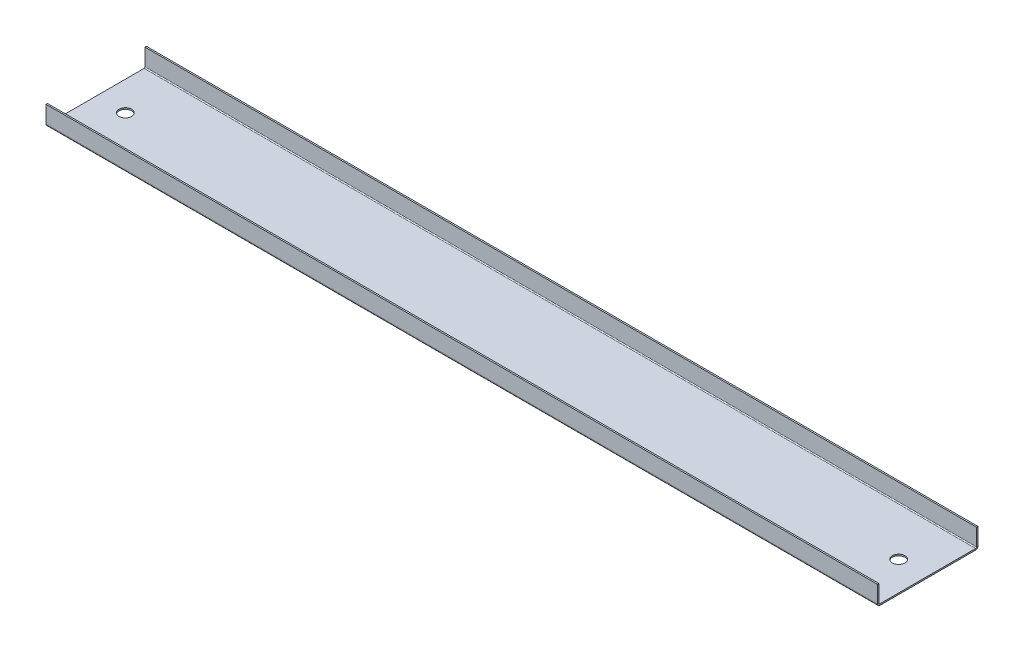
ISO-10303-21;
HEADER;
FILE_DESCRIPTION(('STEP AP214'),'2;1');
FILE_NAME('part.step','',(''),(''),'','','');
FILE_SCHEMA(('AUTOMOTIVE_DESIGN { 1 0 10303 214 1 1 1 1 }'));
ENDSEC;
DATA;
#1=APPLICATION_CONTEXT('core data for automotive mechanical design processes');
#2=APPLICATION_PROTOCOL_DEFINITION('international standard','automotive_design',2000,#1);
#3=PRODUCT_CONTEXT('',#1,'mechanical');
#4=PRODUCT('Part','Part','',(#3));
#5=PRODUCT_RELATED_PRODUCT_CATEGORY('part','',(#4));
#6=PRODUCT_DEFINITION_FORMATION('','',#4);
#7=PRODUCT_DEFINITION_CONTEXT('part definition',#1,'design');
#8=PRODUCT_DEFINITION('design','',#6,#7);
#9=PRODUCT_DEFINITION_SHAPE('','',#8);
#10=(LENGTH_UNIT() NAMED_UNIT(*) SI_UNIT(.MILLI.,.METRE.));
#11=(NAMED_UNIT(*) PLANE_ANGLE_UNIT() SI_UNIT($,.RADIAN.));
#12=(NAMED_UNIT(*) SI_UNIT($,.STERADIAN.) SOLID_ANGLE_UNIT());
#13=UNCERTAINTY_MEASURE_WITH_UNIT(LENGTH_MEASURE(1.E-05),#10,'distance_accuracy_value','');
#14=(GEOMETRIC_REPRESENTATION_CONTEXT(3) GLOBAL_UNCERTAINTY_ASSIGNED_CONTEXT((#13)) GLOBAL_UNIT_ASSIGNED_CONTEXT((#10,
#11,#12)) REPRESENTATION_CONTEXT('',''));
#15=CARTESIAN_POINT('',(0.,0.,0.));
#16=DIRECTION('',(0.,0.,1.));
#17=DIRECTION('',(1.,0.,0.));
#18=AXIS2_PLACEMENT_3D('',#15,#16,#17);
#19=CARTESIAN_POINT('',(-428.4,-334.3,1.49999999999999));
#20=DIRECTION('',(1.,0.,0.));
#21=DIRECTION('',(0.,0.,-1.));
#22=AXIS2_PLACEMENT_3D('',#19,#20,#21);
#23=PLANE('',#22);
#24=DIRECTION('',(0.,-1.,0.));
#25=VECTOR('',#24,1.);
#26=CARTESIAN_POINT('',(-428.4,-332.8,101.));
#27=LINE('',#26,#25);
#28=CARTESIAN_POINT('',(-428.4,-332.8,101.));
#29=VERTEX_POINT('',#28);
#30=CARTESIAN_POINT('',(-428.4,-334.3,101.));
#31=VERTEX_POINT('',#30);
#32=EDGE_CURVE('E234',#29,#31,#27,.T.);
#33=ORIENTED_EDGE('',*,*,#32,.F.);
#34=DIRECTION('',(0.,0.,1.));
#35=VECTOR('',#34,1.);
#36=CARTESIAN_POINT('',(-428.4,-332.8,1.5));
#37=LINE('',#36,#35);
#38=CARTESIAN_POINT('',(-428.4,-332.8,2.5));
#39=VERTEX_POINT('',#38);
#40=EDGE_CURVE('E247',#29,#39,#37,.F.);
#41=ORIENTED_EDGE('',*,*,#40,.T.);
#42=DIRECTION('',(0.,1.,0.));
#43=VECTOR('',#42,1.);
#44=CARTESIAN_POINT('',(-428.4,-334.3,2.5));
#45=LINE('',#44,#43);
#46=CARTESIAN_POINT('',(-428.4,-334.3,2.5));
#47=VERTEX_POINT('',#46);
#48=EDGE_CURVE('E237',#39,#47,#45,.F.);
#49=ORIENTED_EDGE('',*,*,#48,.T.);
#50=DIRECTION('',(0.,0.,-1.));
#51=VECTOR('',#50,1.);
#52=CARTESIAN_POINT('',(-428.4,-334.3,-1.79628818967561E-12));
#53=LINE('',#52,#51);
#54=EDGE_CURVE('E243',#31,#47,#53,.T.);
#55=ORIENTED_EDGE('',*,*,#54,.F.);
#56=EDGE_LOOP('',(#33,#41,#49,#55));
#57=FACE_BOUND('',#56,.T.);
#58=ADVANCED_FACE('F78',(#57),#23,.F.);
#59=CARTESIAN_POINT('',(428.399999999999,-334.3,103.5));
#60=DIRECTION('',(-1.,0.,0.));
#61=DIRECTION('',(0.,0.,1.));
#62=AXIS2_PLACEMENT_3D('',#59,#60,#61);
#63=PLANE('',#62);
#64=DIRECTION('',(0.,-1.,0.));
#65=VECTOR('',#64,1.);
#66=CARTESIAN_POINT('',(428.399999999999,-332.8,101.));
#67=LINE('',#66,#65);
#68=CARTESIAN_POINT('',(428.399999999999,-332.8,101.));
#69=VERTEX_POINT('',#68);
#70=CARTESIAN_POINT('',(428.399999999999,-334.3,101.));
#71=VERTEX_POINT('',#70);
#72=EDGE_CURVE('E228',#69,#71,#67,.T.);
#73=ORIENTED_EDGE('',*,*,#72,.T.);
#74=DIRECTION('',(0.,0.,1.));
#75=VECTOR('',#74,1.);
#76=CARTESIAN_POINT('',(428.399999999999,-334.3,-1.09684768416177E-12));
#77=LINE('',#76,#75);
#78=CARTESIAN_POINT('',(428.399999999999,-334.3,2.5));
#79=VERTEX_POINT('',#78);
#80=EDGE_CURVE('E240',#79,#71,#77,.T.);
#81=ORIENTED_EDGE('',*,*,#80,.F.);
#82=DIRECTION('',(0.,1.,0.));
#83=VECTOR('',#82,1.);
#84=CARTESIAN_POINT('',(428.399999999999,-332.8,2.5));
#85=LINE('',#84,#83);
#86=CARTESIAN_POINT('',(428.399999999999,-332.8,2.5));
#87=VERTEX_POINT('',#86);
#88=EDGE_CURVE('E252',#87,#79,#85,.F.);
#89=ORIENTED_EDGE('',*,*,#88,.F.);
#90=DIRECTION('',(0.,0.,-1.));
#91=VECTOR('',#90,1.);
#92=CARTESIAN_POINT('',(428.399999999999,-332.8,103.5));
#93=LINE('',#92,#91);
#94=EDGE_CURVE('E245',#87,#69,#93,.F.);
#95=ORIENTED_EDGE('',*,*,#94,.T.);
#96=EDGE_LOOP('',(#73,#81,#89,#95));
#97=FACE_BOUND('',#96,.T.);
#98=ADVANCED_FACE('F316',(#97),#63,.F.);
#99=CARTESIAN_POINT('',(0.,-334.3,-1.09684768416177E-12));
#100=DIRECTION('',(0.,1.,0.));
#101=DIRECTION('',(0.,0.,1.));
#102=AXIS2_PLACEMENT_3D('',#99,#100,#101);
#103=PLANE('',#102);
#104=CARTESIAN_POINT('',(-398.4,-334.3,51.7499999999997));
#105=DIRECTION('',(0.,-1.,0.));
#106=DIRECTION('',(0.,0.,-1.));
#107=AXIS2_PLACEMENT_3D('',#104,#105,#106);
#108=CIRCLE('',#107,6.50000000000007);
#109=CARTESIAN_POINT('',(-398.4,-334.3,45.2499999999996));
#110=VERTEX_POINT('',#109);
#111=EDGE_CURVE('E337',#110,#110,#108,.T.);
#112=ORIENTED_EDGE('',*,*,#111,.F.);
#113=EDGE_LOOP('',(#112));
#114=FACE_BOUND('',#113,.T.);
#115=CARTESIAN_POINT('',(398.399999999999,-334.3,51.75));
#116=DIRECTION('',(0.,-1.,0.));
#117=DIRECTION('',(0.,0.,-1.));
#118=AXIS2_PLACEMENT_3D('',#115,#116,#117);
#119=CIRCLE('',#118,6.50000000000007);
#120=CARTESIAN_POINT('',(398.399999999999,-334.3,45.2499999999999));
#121=VERTEX_POINT('',#120);
#122=EDGE_CURVE('E331',#121,#121,#119,.T.);
#123=ORIENTED_EDGE('',*,*,#122,.F.);
#124=EDGE_LOOP('',(#123));
#125=FACE_BOUND('',#124,.T.);
#126=DIRECTION('',(1.,0.,0.));
#127=VECTOR('',#126,1.);
#128=CARTESIAN_POINT('',(428.399999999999,-334.3,101.));
#129=LINE('',#128,#127);
#130=EDGE_CURVE('E177',#71,#31,#129,.F.);
#131=ORIENTED_EDGE('',*,*,#130,.T.);
#132=ORIENTED_EDGE('',*,*,#54,.T.);
#133=DIRECTION('',(1.,0.,0.));
#134=VECTOR('',#133,1.);
#135=CARTESIAN_POINT('',(-428.4,-334.3,2.5));
#136=LINE('',#135,#134);
#137=EDGE_CURVE('E249',#79,#47,#136,.F.);
#138=ORIENTED_EDGE('',*,*,#137,.F.);
#139=ORIENTED_EDGE('',*,*,#80,.T.);
#140=EDGE_LOOP('',(#131,#132,#138,#139));
#141=FACE_BOUND('',#140,.T.);
#142=ADVANCED_FACE('F314',(#114,#125,#141),#103,.F.);
#143=CARTESIAN_POINT('',(0.,-332.8,-1.0916104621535E-12));
#144=DIRECTION('',(0.,1.,0.));
#145=DIRECTION('',(0.,0.,1.));
#146=AXIS2_PLACEMENT_3D('',#143,#144,#145);
#147=PLANE('',#146);
#148=CARTESIAN_POINT('',(-398.4,-332.8,51.7499999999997));
#149=DIRECTION('',(0.,-1.,0.));
#150=DIRECTION('',(0.,0.,-1.));
#151=AXIS2_PLACEMENT_3D('',#148,#149,#150);
#152=CIRCLE('',#151,6.50000000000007);
#153=CARTESIAN_POINT('',(-398.4,-332.8,45.2499999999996));
#154=VERTEX_POINT('',#153);
#155=EDGE_CURVE('E225',#154,#154,#152,.T.);
#156=ORIENTED_EDGE('',*,*,#155,.T.);
#157=EDGE_LOOP('',(#156));
#158=FACE_BOUND('',#157,.T.);
#159=CARTESIAN_POINT('',(398.399999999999,-332.8,51.75));
#160=DIRECTION('',(0.,-1.,0.));
#161=DIRECTION('',(0.,0.,-1.));
#162=AXIS2_PLACEMENT_3D('',#159,#160,#161);
#163=CIRCLE('',#162,6.50000000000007);
#164=CARTESIAN_POINT('',(398.399999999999,-332.8,45.2499999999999));
#165=VERTEX_POINT('',#164);
#166=EDGE_CURVE('E334',#165,#165,#163,.T.);
#167=ORIENTED_EDGE('',*,*,#166,.T.);
#168=EDGE_LOOP('',(#167));
#169=FACE_BOUND('',#168,.T.);
#170=ORIENTED_EDGE('',*,*,#40,.F.);
#171=DIRECTION('',(1.,0.,0.));
#172=VECTOR('',#171,1.);
#173=CARTESIAN_POINT('',(428.399999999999,-332.8,101.));
#174=LINE('',#173,#172);
#175=EDGE_CURVE('E93',#69,#29,#174,.F.);
#176=ORIENTED_EDGE('',*,*,#175,.F.);
#177=ORIENTED_EDGE('',*,*,#94,.F.);
#178=DIRECTION('',(1.,0.,0.));
#179=VECTOR('',#178,1.);
#180=CARTESIAN_POINT('',(-428.4,-332.8,2.5));
#181=LINE('',#180,#179);
#182=EDGE_CURVE('E255',#39,#87,#181,.T.);
#183=ORIENTED_EDGE('',*,*,#182,.F.);
#184=EDGE_LOOP('',(#170,#176,#177,#183));
#185=FACE_BOUND('',#184,.T.);
#186=ADVANCED_FACE('F343',(#158,#169,#185),#147,.T.);
#187=CARTESIAN_POINT('',(-428.4,-314.3,1.5));
#188=DIRECTION('',(1.,0.,0.));
#189=DIRECTION('',(0.,0.,-1.));
#190=AXIS2_PLACEMENT_3D('',#187,#188,#189);
#191=PLANE('',#190);
#192=DIRECTION('',(0.,0.,-1.));
#193=VECTOR('',#192,1.);
#194=CARTESIAN_POINT('',(-428.4,-331.8,1.5));
#195=LINE('',#194,#193);
#196=CARTESIAN_POINT('',(-428.4,-331.8,1.5));
#197=VERTEX_POINT('',#196);
#198=CARTESIAN_POINT('',(-428.4,-331.8,0.));
#199=VERTEX_POINT('',#198);
#200=EDGE_CURVE('E274',#197,#199,#195,.T.);
#201=ORIENTED_EDGE('',*,*,#200,.F.);
#202=DIRECTION('',(0.,-1.,0.));
#203=VECTOR('',#202,1.);
#204=CARTESIAN_POINT('',(-428.4,-314.3,1.5));
#205=LINE('',#204,#203);
#206=CARTESIAN_POINT('',(-428.4,-314.3,1.5));
#207=VERTEX_POINT('',#206);
#208=EDGE_CURVE('E279',#207,#197,#205,.T.);
#209=ORIENTED_EDGE('',*,*,#208,.F.);
#210=DIRECTION('',(0.,0.,-1.));
#211=VECTOR('',#210,1.);
#212=CARTESIAN_POINT('',(-428.4,-314.3,1.5));
#213=LINE('',#212,#211);
#214=CARTESIAN_POINT('',(-428.4,-314.3,0.));
#215=VERTEX_POINT('',#214);
#216=EDGE_CURVE('E86',#207,#215,#213,.T.);
#217=ORIENTED_EDGE('',*,*,#216,.T.);
#218=DIRECTION('',(0.,-1.,0.));
#219=VECTOR('',#218,1.);
#220=CARTESIAN_POINT('',(-428.4,-314.3,0.));
#221=LINE('',#220,#219);
#222=EDGE_CURVE('E277',#215,#199,#221,.T.);
#223=ORIENTED_EDGE('',*,*,#222,.T.);
#224=EDGE_LOOP('',(#201,#209,#217,#223));
#225=FACE_BOUND('',#224,.T.);
#226=ADVANCED_FACE('F80',(#225),#191,.F.);
#227=CARTESIAN_POINT('',(428.4,-314.3,1.5));
#228=DIRECTION('',(-1.,0.,0.));
#229=DIRECTION('',(0.,0.,1.));
#230=AXIS2_PLACEMENT_3D('',#227,#228,#229);
#231=PLANE('',#230);
#232=DIRECTION('',(0.,0.,-1.));
#233=VECTOR('',#232,1.);
#234=CARTESIAN_POINT('',(428.399999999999,-331.8,1.5));
#235=LINE('',#234,#233);
#236=CARTESIAN_POINT('',(428.4,-331.8,1.5));
#237=VERTEX_POINT('',#236);
#238=CARTESIAN_POINT('',(428.399999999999,-331.8,0.));
#239=VERTEX_POINT('',#238);
#240=EDGE_CURVE('E265',#237,#239,#235,.T.);
#241=ORIENTED_EDGE('',*,*,#240,.T.);
#242=DIRECTION('',(0.,1.,0.));
#243=VECTOR('',#242,1.);
#244=CARTESIAN_POINT('',(428.4,-314.3,0.));
#245=LINE('',#244,#243);
#246=CARTESIAN_POINT('',(428.4,-314.3,0.));
#247=VERTEX_POINT('',#246);
#248=EDGE_CURVE('E288',#239,#247,#245,.T.);
#249=ORIENTED_EDGE('',*,*,#248,.T.);
#250=DIRECTION('',(0.,0.,-1.));
#251=VECTOR('',#250,1.);
#252=CARTESIAN_POINT('',(428.4,-314.3,1.5));
#253=LINE('',#252,#251);
#254=CARTESIAN_POINT('',(428.4,-314.3,1.5));
#255=VERTEX_POINT('',#254);
#256=EDGE_CURVE('E13',#255,#247,#253,.T.);
#257=ORIENTED_EDGE('',*,*,#256,.F.);
#258=DIRECTION('',(0.,1.,0.));
#259=VECTOR('',#258,1.);
#260=CARTESIAN_POINT('',(428.4,-314.3,1.5));
#261=LINE('',#260,#259);
#262=EDGE_CURVE('E281',#237,#255,#261,.T.);
#263=ORIENTED_EDGE('',*,*,#262,.F.);
#264=EDGE_LOOP('',(#241,#249,#257,#263));
#265=FACE_BOUND('',#264,.T.);
#266=ADVANCED_FACE('F393',(#265),#231,.F.);
#267=CARTESIAN_POINT('',(0.,0.,1.5));
#268=DIRECTION('',(0.,0.,1.));
#269=DIRECTION('',(1.,0.,0.));
#270=AXIS2_PLACEMENT_3D('',#267,#268,#269);
#271=PLANE('',#270);
#272=ORIENTED_EDGE('',*,*,#208,.T.);
#273=DIRECTION('',(1.,0.,0.));
#274=VECTOR('',#273,1.);
#275=CARTESIAN_POINT('',(428.399999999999,-331.8,1.5));
#276=LINE('',#275,#274);
#277=EDGE_CURVE('E101',#237,#197,#276,.F.);
#278=ORIENTED_EDGE('',*,*,#277,.F.);
#279=ORIENTED_EDGE('',*,*,#262,.T.);
#280=DIRECTION('',(-1.,0.,0.));
#281=VECTOR('',#280,1.);
#282=CARTESIAN_POINT('',(-428.4,-314.3,1.5));
#283=LINE('',#282,#281);
#284=EDGE_CURVE('E284',#255,#207,#283,.T.);
#285=ORIENTED_EDGE('',*,*,#284,.T.);
#286=EDGE_LOOP('',(#272,#278,#279,#285));
#287=FACE_BOUND('',#286,.T.);
#288=ADVANCED_FACE('F390',(#287),#271,.T.);
#289=CARTESIAN_POINT('',(0.,0.,0.));
#290=DIRECTION('',(0.,0.,1.));
#291=DIRECTION('',(1.,0.,0.));
#292=AXIS2_PLACEMENT_3D('',#289,#290,#291);
#293=PLANE('',#292);
#294=DIRECTION('',(1.,0.,0.));
#295=VECTOR('',#294,1.);
#296=CARTESIAN_POINT('',(428.399999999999,-331.8,0.));
#297=LINE('',#296,#295);
#298=EDGE_CURVE('E259',#239,#199,#297,.F.);
#299=ORIENTED_EDGE('',*,*,#298,.T.);
#300=ORIENTED_EDGE('',*,*,#222,.F.);
#301=DIRECTION('',(-1.,0.,0.));
#302=VECTOR('',#301,1.);
#303=CARTESIAN_POINT('',(-428.4,-314.3,0.));
#304=LINE('',#303,#302);
#305=EDGE_CURVE('E282',#247,#215,#304,.T.);
#306=ORIENTED_EDGE('',*,*,#305,.F.);
#307=ORIENTED_EDGE('',*,*,#248,.F.);
#308=EDGE_LOOP('',(#299,#300,#306,#307));
#309=FACE_BOUND('',#308,.T.);
#310=ADVANCED_FACE('F299',(#309),#293,.F.);
#311=CARTESIAN_POINT('',(-428.4,-314.3,1.5));
#312=DIRECTION('',(0.,-1.,0.));
#313=DIRECTION('',(0.,0.,-1.));
#314=AXIS2_PLACEMENT_3D('',#311,#312,#313);
#315=PLANE('',#314);
#316=ORIENTED_EDGE('',*,*,#305,.T.);
#317=ORIENTED_EDGE('',*,*,#216,.F.);
#318=ORIENTED_EDGE('',*,*,#284,.F.);
#319=ORIENTED_EDGE('',*,*,#256,.T.);
#320=EDGE_LOOP('',(#316,#317,#318,#319));
#321=FACE_BOUND('',#320,.T.);
#322=ADVANCED_FACE('F386',(#321),#315,.F.);
#323=CARTESIAN_POINT('',(-428.4,-331.8,2.50000000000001));
#324=DIRECTION('',(-1.,0.,0.));
#325=DIRECTION('',(0.,0.,1.));
#326=AXIS2_PLACEMENT_3D('',#323,#324,#325);
#327=PLANE('',#326);
#328=ORIENTED_EDGE('',*,*,#48,.F.);
#329=CARTESIAN_POINT('',(-428.4,-331.8,2.50000000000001));
#330=DIRECTION('',(1.,0.,0.));
#331=DIRECTION('',(0.,0.,-1.));
#332=AXIS2_PLACEMENT_3D('',#329,#330,#331);
#333=CIRCLE('',#332,1.);
#334=EDGE_CURVE('E268',#197,#39,#333,.F.);
#335=ORIENTED_EDGE('',*,*,#334,.F.);
#336=ORIENTED_EDGE('',*,*,#200,.T.);
#337=CARTESIAN_POINT('',(-428.4,-331.8,2.50000000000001));
#338=DIRECTION('',(1.,0.,0.));
#339=DIRECTION('',(0.,0.,-1.));
#340=AXIS2_PLACEMENT_3D('',#337,#338,#339);
#341=CIRCLE('',#340,2.5);
#342=EDGE_CURVE('E261',#199,#47,#341,.F.);
#343=ORIENTED_EDGE('',*,*,#342,.T.);
#344=EDGE_LOOP('',(#328,#335,#336,#343));
#345=FACE_BOUND('',#344,.T.);
#346=ADVANCED_FACE('F383',(#345),#327,.T.);
#347=CARTESIAN_POINT('',(428.399999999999,-331.8,2.50000000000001));
#348=DIRECTION('',(-1.,0.,0.));
#349=DIRECTION('',(0.,0.,1.));
#350=AXIS2_PLACEMENT_3D('',#347,#348,#349);
#351=PLANE('',#350);
#352=CARTESIAN_POINT('',(428.399999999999,-331.8,2.50000000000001));
#353=DIRECTION('',(1.,0.,0.));
#354=DIRECTION('',(0.,0.,-1.));
#355=AXIS2_PLACEMENT_3D('',#352,#353,#354);
#356=CIRCLE('',#355,1.);
#357=EDGE_CURVE('E242',#87,#237,#356,.T.);
#358=ORIENTED_EDGE('',*,*,#357,.F.);
#359=ORIENTED_EDGE('',*,*,#88,.T.);
#360=CARTESIAN_POINT('',(428.399999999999,-331.8,2.50000000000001));
#361=DIRECTION('',(1.,0.,0.));
#362=DIRECTION('',(0.,0.,-1.));
#363=AXIS2_PLACEMENT_3D('',#360,#361,#362);
#364=CIRCLE('',#363,2.5);
#365=EDGE_CURVE('E262',#79,#239,#364,.T.);
#366=ORIENTED_EDGE('',*,*,#365,.T.);
#367=ORIENTED_EDGE('',*,*,#240,.F.);
#368=EDGE_LOOP('',(#358,#359,#366,#367));
#369=FACE_BOUND('',#368,.T.);
#370=ADVANCED_FACE('F308',(#369),#351,.F.);
#371=CARTESIAN_POINT('',(428.399999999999,-331.8,2.50000000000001));
#372=DIRECTION('',(1.,0.,0.));
#373=DIRECTION('',(0.,-1.,0.));
#374=AXIS2_PLACEMENT_3D('',#371,#372,#373);
#375=CYLINDRICAL_SURFACE('',#374,2.5);
#376=ORIENTED_EDGE('',*,*,#298,.F.);
#377=ORIENTED_EDGE('',*,*,#365,.F.);
#378=ORIENTED_EDGE('',*,*,#137,.T.);
#379=ORIENTED_EDGE('',*,*,#342,.F.);
#380=EDGE_LOOP('',(#376,#377,#378,#379));
#381=FACE_BOUND('',#380,.T.);
#382=ADVANCED_FACE('F304',(#381),#375,.T.);
#383=CARTESIAN_POINT('',(428.399999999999,-331.8,2.50000000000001));
#384=DIRECTION('',(1.,0.,0.));
#385=DIRECTION('',(0.,-1.,0.));
#386=AXIS2_PLACEMENT_3D('',#383,#384,#385);
#387=CYLINDRICAL_SURFACE('',#386,1.);
#388=ORIENTED_EDGE('',*,*,#277,.T.);
#389=ORIENTED_EDGE('',*,*,#334,.T.);
#390=ORIENTED_EDGE('',*,*,#182,.T.);
#391=ORIENTED_EDGE('',*,*,#357,.T.);
#392=EDGE_LOOP('',(#388,#389,#390,#391));
#393=FACE_BOUND('',#392,.T.);
#394=ADVANCED_FACE('F378',(#393),#387,.F.);
#395=CARTESIAN_POINT('',(-428.4,-331.8,101.));
#396=DIRECTION('',(-1.,0.,0.));
#397=DIRECTION('',(0.,0.,1.));
#398=AXIS2_PLACEMENT_3D('',#395,#396,#397);
#399=PLANE('',#398);
#400=DIRECTION('',(0.,0.,1.));
#401=VECTOR('',#400,1.);
#402=CARTESIAN_POINT('',(-428.4,-331.8,103.5));
#403=LINE('',#402,#401);
#404=CARTESIAN_POINT('',(-428.4,-331.8,102.));
#405=VERTEX_POINT('',#404);
#406=CARTESIAN_POINT('',(-428.4,-331.8,103.5));
#407=VERTEX_POINT('',#406);
#408=EDGE_CURVE('E222',#405,#407,#403,.T.);
#409=ORIENTED_EDGE('',*,*,#408,.F.);
#410=CARTESIAN_POINT('',(-428.4,-331.8,101.));
#411=DIRECTION('',(1.,0.,0.));
#412=DIRECTION('',(0.,0.,-1.));
#413=AXIS2_PLACEMENT_3D('',#410,#411,#412);
#414=CIRCLE('',#413,1.);
#415=EDGE_CURVE('E180',#29,#405,#414,.F.);
#416=ORIENTED_EDGE('',*,*,#415,.F.);
#417=ORIENTED_EDGE('',*,*,#32,.T.);
#418=CARTESIAN_POINT('',(-428.4,-331.8,101.));
#419=DIRECTION('',(1.,0.,0.));
#420=DIRECTION('',(0.,0.,-1.));
#421=AXIS2_PLACEMENT_3D('',#418,#419,#420);
#422=CIRCLE('',#421,2.5);
#423=EDGE_CURVE('E227',#31,#407,#422,.F.);
#424=ORIENTED_EDGE('',*,*,#423,.T.);
#425=EDGE_LOOP('',(#409,#416,#417,#424));
#426=FACE_BOUND('',#425,.T.);
#427=ADVANCED_FACE('F381',(#426),#399,.T.);
#428=CARTESIAN_POINT('',(428.399999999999,-331.8,101.));
#429=DIRECTION('',(-1.,0.,0.));
#430=DIRECTION('',(0.,0.,1.));
#431=AXIS2_PLACEMENT_3D('',#428,#429,#430);
#432=PLANE('',#431);
#433=CARTESIAN_POINT('',(428.399999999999,-331.8,101.));
#434=DIRECTION('',(1.,0.,0.));
#435=DIRECTION('',(0.,0.,-1.));
#436=AXIS2_PLACEMENT_3D('',#433,#434,#435);
#437=CIRCLE('',#436,1.);
#438=CARTESIAN_POINT('',(428.399999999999,-331.8,102.));
#439=VERTEX_POINT('',#438);
#440=EDGE_CURVE('E187',#439,#69,#437,.T.);
#441=ORIENTED_EDGE('',*,*,#440,.F.);
#442=DIRECTION('',(0.,0.,1.));
#443=VECTOR('',#442,1.);
#444=CARTESIAN_POINT('',(428.399999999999,-331.800000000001,102.));
#445=LINE('',#444,#443);
#446=CARTESIAN_POINT('',(428.399999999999,-331.800000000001,103.5));
#447=VERTEX_POINT('',#446);
#448=EDGE_CURVE('E184',#439,#447,#445,.T.);
#449=ORIENTED_EDGE('',*,*,#448,.T.);
#450=CARTESIAN_POINT('',(428.399999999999,-331.8,101.));
#451=DIRECTION('',(1.,0.,0.));
#452=DIRECTION('',(0.,0.,-1.));
#453=AXIS2_PLACEMENT_3D('',#450,#451,#452);
#454=CIRCLE('',#453,2.5);
#455=EDGE_CURVE('E170',#447,#71,#454,.T.);
#456=ORIENTED_EDGE('',*,*,#455,.T.);
#457=ORIENTED_EDGE('',*,*,#72,.F.);
#458=EDGE_LOOP('',(#441,#449,#456,#457));
#459=FACE_BOUND('',#458,.T.);
#460=ADVANCED_FACE('F185',(#459),#432,.F.);
#461=CARTESIAN_POINT('',(428.399999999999,-331.8,101.));
#462=DIRECTION('',(1.,0.,0.));
#463=DIRECTION('',(0.,0.,1.));
#464=AXIS2_PLACEMENT_3D('',#461,#462,#463);
#465=CYLINDRICAL_SURFACE('',#464,2.5);
#466=ORIENTED_EDGE('',*,*,#130,.F.);
#467=ORIENTED_EDGE('',*,*,#455,.F.);
#468=DIRECTION('',(1.,0.,0.));
#469=VECTOR('',#468,1.);
#470=CARTESIAN_POINT('',(0.,-331.800000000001,103.5));
#471=LINE('',#470,#469);
#472=EDGE_CURVE('E175',#407,#447,#471,.T.);
#473=ORIENTED_EDGE('',*,*,#472,.F.);
#474=ORIENTED_EDGE('',*,*,#423,.F.);
#475=EDGE_LOOP('',(#466,#467,#473,#474));
#476=FACE_BOUND('',#475,.T.);
#477=ADVANCED_FACE('F172',(#476),#465,.T.);
#478=CARTESIAN_POINT('',(428.399999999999,-331.8,101.));
#479=DIRECTION('',(1.,0.,0.));
#480=DIRECTION('',(0.,0.,1.));
#481=AXIS2_PLACEMENT_3D('',#478,#479,#480);
#482=CYLINDRICAL_SURFACE('',#481,1.);
#483=ORIENTED_EDGE('',*,*,#175,.T.);
#484=ORIENTED_EDGE('',*,*,#415,.T.);
#485=DIRECTION('',(-1.,0.,0.));
#486=VECTOR('',#485,1.);
#487=CARTESIAN_POINT('',(-428.4,-331.8,102.));
#488=LINE('',#487,#486);
#489=EDGE_CURVE('E192',#405,#439,#488,.F.);
#490=ORIENTED_EDGE('',*,*,#489,.T.);
#491=ORIENTED_EDGE('',*,*,#440,.T.);
#492=EDGE_LOOP('',(#483,#484,#490,#491));
#493=FACE_BOUND('',#492,.T.);
#494=ADVANCED_FACE('F318',(#493),#482,.F.);
#495=CARTESIAN_POINT('',(428.399999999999,-332.8,103.5));
#496=DIRECTION('',(1.,0.,0.));
#497=DIRECTION('',(0.,0.,-1.));
#498=AXIS2_PLACEMENT_3D('',#495,#496,#497);
#499=PLANE('',#498);
#500=DIRECTION('',(0.,-1.,0.));
#501=VECTOR('',#500,1.);
#502=CARTESIAN_POINT('',(428.399999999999,-332.8,103.5));
#503=LINE('',#502,#501);
#504=CARTESIAN_POINT('',(428.399999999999,-314.3,103.5));
#505=VERTEX_POINT('',#504);
#506=EDGE_CURVE('E199',#505,#447,#503,.T.);
#507=ORIENTED_EDGE('',*,*,#506,.T.);
#508=ORIENTED_EDGE('',*,*,#448,.F.);
#509=DIRECTION('',(0.,1.,0.));
#510=VECTOR('',#509,1.);
#511=CARTESIAN_POINT('',(428.399999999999,-6.93867327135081E-13,102.000000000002));
#512=LINE('',#511,#510);
#513=CARTESIAN_POINT('',(428.399999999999,-314.3,102.));
#514=VERTEX_POINT('',#513);
#515=EDGE_CURVE('E215',#514,#439,#512,.F.);
#516=ORIENTED_EDGE('',*,*,#515,.F.);
#517=DIRECTION('',(0.,0.,-1.));
#518=VECTOR('',#517,1.);
#519=CARTESIAN_POINT('',(428.399999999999,-314.3,103.5));
#520=LINE('',#519,#518);
#521=EDGE_CURVE('E204',#505,#514,#520,.T.);
#522=ORIENTED_EDGE('',*,*,#521,.F.);
#523=EDGE_LOOP('',(#507,#508,#516,#522));
#524=FACE_BOUND('',#523,.T.);
#525=ADVANCED_FACE('F203',(#524),#499,.T.);
#526=CARTESIAN_POINT('',(-428.4,-314.3,103.5));
#527=DIRECTION('',(-1.,0.,0.));
#528=DIRECTION('',(0.,-1.,0.));
#529=AXIS2_PLACEMENT_3D('',#526,#527,#528);
#530=PLANE('',#529);
#531=DIRECTION('',(0.,-1.,0.));
#532=VECTOR('',#531,1.);
#533=CARTESIAN_POINT('',(-428.399999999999,5.91590899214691E-13,102.000000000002));
#534=LINE('',#533,#532);
#535=CARTESIAN_POINT('',(-428.4,-314.3,102.));
#536=VERTEX_POINT('',#535);
#537=EDGE_CURVE('E201',#405,#536,#534,.F.);
#538=ORIENTED_EDGE('',*,*,#537,.F.);
#539=ORIENTED_EDGE('',*,*,#408,.T.);
#540=DIRECTION('',(0.,1.,0.));
#541=VECTOR('',#540,1.);
#542=CARTESIAN_POINT('',(-428.4,-314.3,103.5));
#543=LINE('',#542,#541);
#544=CARTESIAN_POINT('',(-428.4,-314.3,103.5));
#545=VERTEX_POINT('',#544);
#546=EDGE_CURVE('E200',#407,#545,#543,.T.);
#547=ORIENTED_EDGE('',*,*,#546,.T.);
#548=DIRECTION('',(0.,0.,-1.));
#549=VECTOR('',#548,1.);
#550=CARTESIAN_POINT('',(-428.4,-314.3,103.5));
#551=LINE('',#550,#549);
#552=EDGE_CURVE('E206',#545,#536,#551,.T.);
#553=ORIENTED_EDGE('',*,*,#552,.T.);
#554=EDGE_LOOP('',(#538,#539,#547,#553));
#555=FACE_BOUND('',#554,.T.);
#556=ADVANCED_FACE('F325',(#555),#530,.T.);
#557=CARTESIAN_POINT('',(0.,-7.04002591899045E-13,103.500000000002));
#558=DIRECTION('',(0.,0.,1.));
#559=DIRECTION('',(0.,-1.,0.));
#560=AXIS2_PLACEMENT_3D('',#557,#558,#559);
#561=PLANE('',#560);
#562=ORIENTED_EDGE('',*,*,#546,.F.);
#563=ORIENTED_EDGE('',*,*,#472,.T.);
#564=ORIENTED_EDGE('',*,*,#506,.F.);
#565=DIRECTION('',(1.,0.,0.));
#566=VECTOR('',#565,1.);
#567=CARTESIAN_POINT('',(428.399999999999,-314.3,103.5));
#568=LINE('',#567,#566);
#569=EDGE_CURVE('E207',#545,#505,#568,.T.);
#570=ORIENTED_EDGE('',*,*,#569,.F.);
#571=EDGE_LOOP('',(#562,#563,#564,#570));
#572=FACE_BOUND('',#571,.T.);
#573=ADVANCED_FACE('F197',(#572),#561,.T.);
#574=CARTESIAN_POINT('',(0.,-6.93867327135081E-13,102.000000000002));
#575=DIRECTION('',(0.,0.,1.));
#576=DIRECTION('',(0.,-1.,0.));
#577=AXIS2_PLACEMENT_3D('',#574,#575,#576);
#578=PLANE('',#577);
#579=ORIENTED_EDGE('',*,*,#489,.F.);
#580=ORIENTED_EDGE('',*,*,#537,.T.);
#581=DIRECTION('',(-1.,0.,0.));
#582=VECTOR('',#581,1.);
#583=CARTESIAN_POINT('',(0.,-314.3,102.));
#584=LINE('',#583,#582);
#585=EDGE_CURVE('E217',#536,#514,#584,.F.);
#586=ORIENTED_EDGE('',*,*,#585,.T.);
#587=ORIENTED_EDGE('',*,*,#515,.T.);
#588=EDGE_LOOP('',(#579,#580,#586,#587));
#589=FACE_BOUND('',#588,.T.);
#590=ADVANCED_FACE('F323',(#589),#578,.F.);
#591=CARTESIAN_POINT('',(428.399999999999,-314.3,103.5));
#592=DIRECTION('',(0.,1.,0.));
#593=DIRECTION('',(0.,0.,1.));
#594=AXIS2_PLACEMENT_3D('',#591,#592,#593);
#595=PLANE('',#594);
#596=ORIENTED_EDGE('',*,*,#585,.F.);
#597=ORIENTED_EDGE('',*,*,#552,.F.);
#598=ORIENTED_EDGE('',*,*,#569,.T.);
#599=ORIENTED_EDGE('',*,*,#521,.T.);
#600=EDGE_LOOP('',(#596,#597,#598,#599));
#601=FACE_BOUND('',#600,.T.);
#602=ADVANCED_FACE('F329',(#601),#595,.T.);
#603=CARTESIAN_POINT('',(398.399999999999,-332.8,51.75));
#604=DIRECTION('',(0.,-1.,0.));
#605=DIRECTION('',(0.,0.,-1.));
#606=AXIS2_PLACEMENT_3D('',#603,#604,#605);
#607=CYLINDRICAL_SURFACE('',#606,6.50000000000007);
#608=ORIENTED_EDGE('',*,*,#166,.F.);
#609=EDGE_LOOP('',(#608));
#610=FACE_BOUND('',#609,.T.);
#611=ORIENTED_EDGE('',*,*,#122,.T.);
#612=EDGE_LOOP('',(#611));
#613=FACE_BOUND('',#612,.T.);
#614=ADVANCED_FACE('F349',(#610,#613),#607,.F.);
#615=CARTESIAN_POINT('',(-398.4,-332.8,51.7499999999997));
#616=DIRECTION('',(0.,-1.,0.));
#617=DIRECTION('',(0.,0.,-1.));
#618=AXIS2_PLACEMENT_3D('',#615,#616,#617);
#619=CYLINDRICAL_SURFACE('',#618,6.50000000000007);
#620=ORIENTED_EDGE('',*,*,#155,.F.);
#621=EDGE_LOOP('',(#620));
#622=FACE_BOUND('',#621,.T.);
#623=ORIENTED_EDGE('',*,*,#111,.T.);
#624=EDGE_LOOP('',(#623));
#625=FACE_BOUND('',#624,.T.);
#626=ADVANCED_FACE('F346',(#622,#625),#619,.F.);
#627=CLOSED_SHELL('',(#58,#98,#142,#186,#226,#266,#288,#310,#322,#346,#370,#382,#394,#427,#460,
#477,#494,#525,#556,#573,#590,#602,#614,#626));
#628=MANIFOLD_SOLID_BREP('B2',#627);
#629=ADVANCED_BREP_SHAPE_REPRESENTATION('',(#18,#628),#14);
#630=SHAPE_DEFINITION_REPRESENTATION(#9,#629);
ENDSEC;
END-ISO-10303-21;
